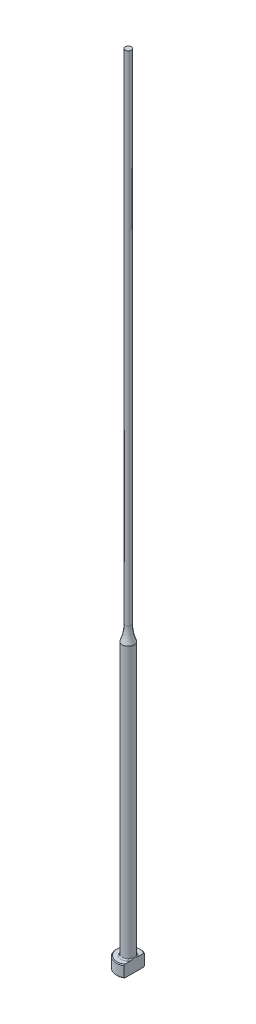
from build123d import *
from build123d.topology import SkipClean

# Parameters (mm, degrees)
CHAMFER1_SIZE = 0.2
FILLET1_R     = 0.3
KEY_DEPTH     = 201.044994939


with BuildPart() as part:
    # Sketch1 → Revolve1 (revolve)
    with BuildSketch(Plane.XY, mode=Mode.PRIVATE) as revolve1_sk:
        with BuildLine():
            Line((0, 0), (-3, 0))
            Line((-3, 0), (-3, 3))
            Line((-3, 3), (-1.5, 3))
            Line((-1.5, 3), (-1.5, 71.200328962))
            ThreePointArc((-1.5, 71.200328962), (-0.939291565, 73.063508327), (-0.75, 75))
            Line((-0.75, 75), (-0.75, 200))
            Line((-0.75, 200), (0, 200))
            Line((0, 200), (0, 0))
        make_face()
    revolve(revolve1_sk.sketch.rotate(Axis((0, 259.958771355, 0), (0, -1, 0)), 270), axis=Axis((0, 259.958771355, 0), (0, -1, 0)))

    # Chamfer1
    chamfer1_edges = [part.edges().sort_by_distance(p)[0] for p in [
        (0, 0, -3),
        (0, 3, -3),
    ]]
    chamfer(chamfer1_edges, length=CHAMFER1_SIZE)

    # Fillet1
    fillet1_edges = [part.edges().sort_by_distance(p)[0] for p in [
        (0, 3, -1.5),
    ]]
    fillet(fillet1_edges, radius=FILLET1_R)

    # Sketch2 → KEY (cut, through all)
    with SkipClean():  # the faces are left unmerged after this step: merging them gives an invalid solid
        with BuildSketch(Plane(origin=(0, 0, 0), x_dir=(1, 0, 0), z_dir=(0, 1, 0))):
            with BuildLine():
                Line((1.5, 2.598076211), (1.5, -2.598076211))
                ThreePointArc((1.5, -2.598076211), (3, 0), (1.5, 2.598076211))
            make_face()
        extrude(amount=KEY_DEPTH, mode=Mode.SUBTRACT)


solid = part.part
